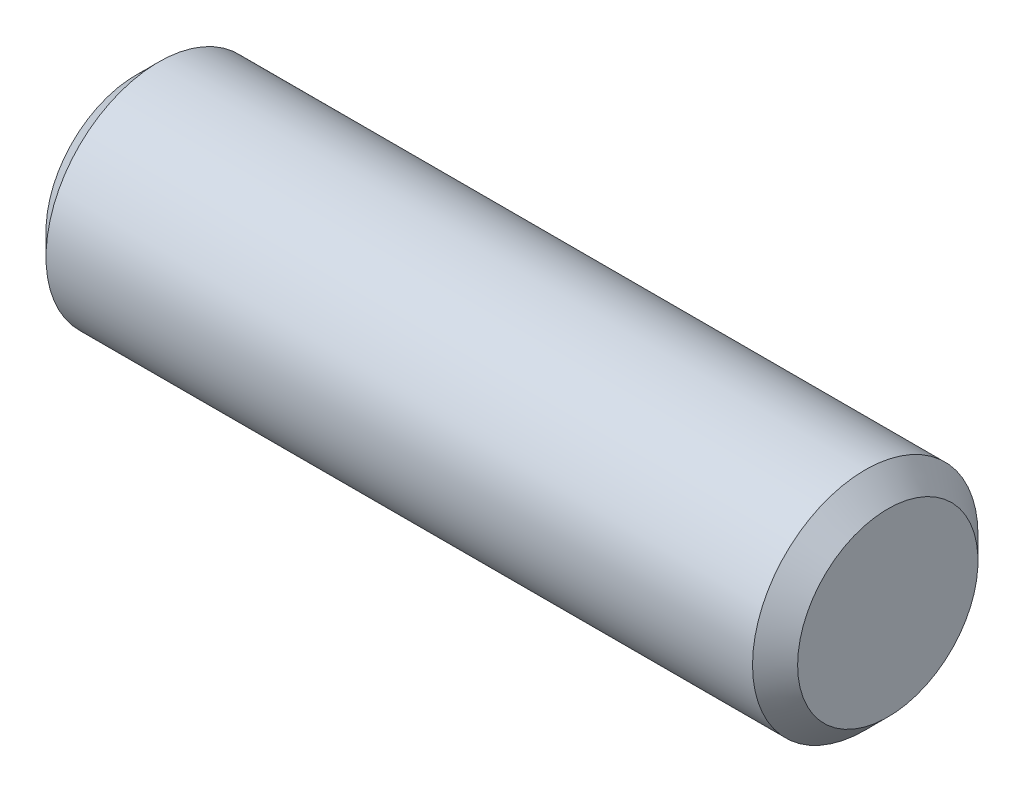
ISO-10303-21;
HEADER;
FILE_DESCRIPTION(('STEP AP214'),'2;1');
FILE_NAME('part.step','',(''),(''),'','','');
FILE_SCHEMA(('AUTOMOTIVE_DESIGN { 1 0 10303 214 1 1 1 1 }'));
ENDSEC;
DATA;
#1=APPLICATION_CONTEXT('core data for automotive mechanical design processes');
#2=APPLICATION_PROTOCOL_DEFINITION('international standard','automotive_design',2000,#1);
#3=PRODUCT_CONTEXT('',#1,'mechanical');
#4=PRODUCT('Part','Part','',(#3));
#5=PRODUCT_RELATED_PRODUCT_CATEGORY('part','',(#4));
#6=PRODUCT_DEFINITION_FORMATION('','',#4);
#7=PRODUCT_DEFINITION_CONTEXT('part definition',#1,'design');
#8=PRODUCT_DEFINITION('design','',#6,#7);
#9=PRODUCT_DEFINITION_SHAPE('','',#8);
#10=(LENGTH_UNIT() NAMED_UNIT(*) SI_UNIT(.MILLI.,.METRE.));
#11=(NAMED_UNIT(*) PLANE_ANGLE_UNIT() SI_UNIT($,.RADIAN.));
#12=(NAMED_UNIT(*) SI_UNIT($,.STERADIAN.) SOLID_ANGLE_UNIT());
#13=UNCERTAINTY_MEASURE_WITH_UNIT(LENGTH_MEASURE(1.E-05),#10,'distance_accuracy_value','');
#14=(GEOMETRIC_REPRESENTATION_CONTEXT(3) GLOBAL_UNCERTAINTY_ASSIGNED_CONTEXT((#13)) GLOBAL_UNIT_ASSIGNED_CONTEXT((#10,
#11,#12)) REPRESENTATION_CONTEXT('',''));
#15=CARTESIAN_POINT('',(0.,0.,0.));
#16=DIRECTION('',(0.,0.,1.));
#17=DIRECTION('',(1.,0.,0.));
#18=AXIS2_PLACEMENT_3D('',#15,#16,#17);
#19=CARTESIAN_POINT('',(-3.96875,0.,0.));
#20=DIRECTION('',(1.,0.,0.));
#21=DIRECTION('',(0.,0.,-1.));
#22=AXIS2_PLACEMENT_3D('',#19,#20,#21);
#23=CYLINDRICAL_SURFACE('',#22,1.190625);
#24=CARTESIAN_POINT('',(3.730625,0.,0.));
#25=DIRECTION('',(1.,0.,0.));
#26=DIRECTION('',(0.,0.,-1.));
#27=AXIS2_PLACEMENT_3D('',#24,#25,#26);
#28=CIRCLE('',#27,1.190625);
#29=CARTESIAN_POINT('',(3.730625,0.,1.190625));
#30=VERTEX_POINT('',#29);
#31=EDGE_CURVE('E44',#30,#30,#28,.F.);
#32=ORIENTED_EDGE('',*,*,#31,.T.);
#33=EDGE_LOOP('',(#32));
#34=FACE_BOUND('',#33,.T.);
#35=CARTESIAN_POINT('',(-3.730625,0.,0.));
#36=DIRECTION('',(1.,0.,0.));
#37=DIRECTION('',(0.,0.,-1.));
#38=AXIS2_PLACEMENT_3D('',#35,#36,#37);
#39=CIRCLE('',#38,1.190625);
#40=CARTESIAN_POINT('',(-3.730625,0.,-1.190625));
#41=VERTEX_POINT('',#40);
#42=EDGE_CURVE('E50',#41,#41,#39,.T.);
#43=ORIENTED_EDGE('',*,*,#42,.T.);
#44=EDGE_LOOP('',(#43));
#45=FACE_BOUND('',#44,.T.);
#46=ADVANCED_FACE('F36',(#34,#45),#23,.T.);
#47=CARTESIAN_POINT('',(-3.96875,0.,0.));
#48=DIRECTION('',(1.,0.,0.));
#49=DIRECTION('',(0.,0.,-1.));
#50=AXIS2_PLACEMENT_3D('',#47,#48,#49);
#51=PLANE('',#50);
#52=CARTESIAN_POINT('',(-3.96875,0.,0.));
#53=DIRECTION('',(1.,0.,0.));
#54=DIRECTION('',(0.,0.,-1.));
#55=AXIS2_PLACEMENT_3D('',#52,#53,#54);
#56=CIRCLE('',#55,0.9525);
#57=CARTESIAN_POINT('',(-3.96875,0.,-0.9525));
#58=VERTEX_POINT('',#57);
#59=EDGE_CURVE('E10',#58,#58,#56,.F.);
#60=ORIENTED_EDGE('',*,*,#59,.T.);
#61=EDGE_LOOP('',(#60));
#62=FACE_BOUND('',#61,.T.);
#63=ADVANCED_FACE('F71',(#62),#51,.F.);
#64=CARTESIAN_POINT('',(3.96875,0.,0.));
#65=DIRECTION('',(1.,0.,0.));
#66=DIRECTION('',(0.,0.,-1.));
#67=AXIS2_PLACEMENT_3D('',#64,#65,#66);
#68=PLANE('',#67);
#69=CARTESIAN_POINT('',(3.96875,0.,0.));
#70=DIRECTION('',(1.,0.,0.));
#71=DIRECTION('',(0.,0.,-1.));
#72=AXIS2_PLACEMENT_3D('',#69,#70,#71);
#73=CIRCLE('',#72,0.9525);
#74=CARTESIAN_POINT('',(3.96875,0.,0.952500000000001));
#75=VERTEX_POINT('',#74);
#76=EDGE_CURVE('E55',#75,#75,#73,.T.);
#77=ORIENTED_EDGE('',*,*,#76,.T.);
#78=EDGE_LOOP('',(#77));
#79=FACE_BOUND('',#78,.T.);
#80=ADVANCED_FACE('F61',(#79),#68,.T.);
#81=CARTESIAN_POINT('',(3.96875,0.,0.));
#82=DIRECTION('',(-1.,0.,0.));
#83=DIRECTION('',(0.,0.,1.));
#84=AXIS2_PLACEMENT_3D('',#81,#82,#83);
#85=CONICAL_SURFACE('',#84,0.9525,0.785398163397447);
#86=CARTESIAN_POINT('',(3.730625,0.,1.190625));
#87=CARTESIAN_POINT('',(3.73310546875,0.,1.18814453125));
#88=CARTESIAN_POINT('',(3.7355859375,0.,1.1856640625));
#89=CARTESIAN_POINT('',(3.740546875,0.,1.180703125));
#90=CARTESIAN_POINT('',(3.74302734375,0.,1.17822265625));
#91=CARTESIAN_POINT('',(3.74798828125,0.,1.17326171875));
#92=CARTESIAN_POINT('',(3.75046875,0.,1.17078125));
#93=CARTESIAN_POINT('',(3.7554296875,0.,1.1658203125));
#94=CARTESIAN_POINT('',(3.75791015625,0.,1.16333984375));
#95=CARTESIAN_POINT('',(3.76287109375,0.,1.15837890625));
#96=CARTESIAN_POINT('',(3.7653515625,0.,1.1558984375));
#97=CARTESIAN_POINT('',(3.7703125,0.,1.1509375));
#98=CARTESIAN_POINT('',(3.77279296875,0.,1.14845703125));
#99=CARTESIAN_POINT('',(3.77775390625,0.,1.14349609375));
#100=CARTESIAN_POINT('',(3.780234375,0.,1.141015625));
#101=CARTESIAN_POINT('',(3.7851953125,0.,1.1360546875));
#102=CARTESIAN_POINT('',(3.78767578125,0.,1.13357421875));
#103=CARTESIAN_POINT('',(3.79263671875,0.,1.12861328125));
#104=CARTESIAN_POINT('',(3.7951171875,0.,1.1261328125));
#105=CARTESIAN_POINT('',(3.800078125,0.,1.121171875));
#106=CARTESIAN_POINT('',(3.80255859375,0.,1.11869140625));
#107=CARTESIAN_POINT('',(3.80751953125,0.,1.11373046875));
#108=CARTESIAN_POINT('',(3.81,0.,1.11125));
#109=CARTESIAN_POINT('',(3.8149609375,0.,1.1062890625));
#110=CARTESIAN_POINT('',(3.81744140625,0.,1.10380859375));
#111=CARTESIAN_POINT('',(3.82240234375,0.,1.09884765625));
#112=CARTESIAN_POINT('',(3.8248828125,0.,1.0963671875));
#113=CARTESIAN_POINT('',(3.82984375,0.,1.09140625));
#114=CARTESIAN_POINT('',(3.83232421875,0.,1.08892578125));
#115=CARTESIAN_POINT('',(3.83728515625,0.,1.08396484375));
#116=CARTESIAN_POINT('',(3.839765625,0.,1.081484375));
#117=CARTESIAN_POINT('',(3.8447265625,0.,1.0765234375));
#118=CARTESIAN_POINT('',(3.84720703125,0.,1.07404296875));
#119=CARTESIAN_POINT('',(3.85216796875,0.,1.06908203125));
#120=CARTESIAN_POINT('',(3.8546484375,0.,1.0666015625));
#121=CARTESIAN_POINT('',(3.859609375,0.,1.061640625));
#122=CARTESIAN_POINT('',(3.86208984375,0.,1.05916015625));
#123=CARTESIAN_POINT('',(3.86705078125,0.,1.05419921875));
#124=CARTESIAN_POINT('',(3.86953125,0.,1.05171875));
#125=CARTESIAN_POINT('',(3.8744921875,0.,1.0467578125));
#126=CARTESIAN_POINT('',(3.87697265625,0.,1.04427734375));
#127=CARTESIAN_POINT('',(3.88193359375,0.,1.03931640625));
#128=CARTESIAN_POINT('',(3.8844140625,0.,1.0368359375));
#129=CARTESIAN_POINT('',(3.889375,0.,1.031875));
#130=CARTESIAN_POINT('',(3.89185546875,0.,1.02939453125));
#131=CARTESIAN_POINT('',(3.89681640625,0.,1.02443359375));
#132=CARTESIAN_POINT('',(3.899296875,0.,1.021953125));
#133=CARTESIAN_POINT('',(3.9042578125,0.,1.0169921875));
#134=CARTESIAN_POINT('',(3.90673828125,0.,1.01451171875));
#135=CARTESIAN_POINT('',(3.91169921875,0.,1.00955078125));
#136=CARTESIAN_POINT('',(3.9141796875,0.,1.0070703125));
#137=CARTESIAN_POINT('',(3.919140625,0.,1.002109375));
#138=CARTESIAN_POINT('',(3.92162109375,0.,0.999628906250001));
#139=CARTESIAN_POINT('',(3.92658203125,0.,0.994667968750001));
#140=CARTESIAN_POINT('',(3.9290625,0.,0.992187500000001));
#141=CARTESIAN_POINT('',(3.9340234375,0.,0.987226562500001));
#142=CARTESIAN_POINT('',(3.93650390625,0.,0.984746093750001));
#143=CARTESIAN_POINT('',(3.94146484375,0.,0.979785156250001));
#144=CARTESIAN_POINT('',(3.9439453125,0.,0.977304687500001));
#145=CARTESIAN_POINT('',(3.94890625,0.,0.972343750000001));
#146=CARTESIAN_POINT('',(3.95138671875,0.,0.969863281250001));
#147=CARTESIAN_POINT('',(3.95634765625,0.,0.964902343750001));
#148=CARTESIAN_POINT('',(3.958828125,0.,0.962421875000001));
#149=CARTESIAN_POINT('',(3.9637890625,0.,0.957460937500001));
#150=CARTESIAN_POINT('',(3.96626953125,0.,0.954980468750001));
#151=CARTESIAN_POINT('',(3.96875,0.,0.952500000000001));
#152=B_SPLINE_CURVE_WITH_KNOTS('',3,(#86,#87,#88,#89,#90,#91,#92,#93,#94,#95,#96,#97,#98,#99,
#100,#101,#102,#103,#104,#105,#106,#107,#108,#109,#110,#111,#112,#113,#114,#115,#116,#117,#118,
#119,#120,#121,#122,#123,#124,#125,#126,#127,#128,#129,#130,#131,#132,#133,#134,#135,#136,#137,
#138,#139,#140,#141,#142,#143,#144,#145,#146,#147,#148,#149,#150,#151),.UNSPECIFIED.,.F.,.F.,(4,
2,2,2,2,2,2,2,2,2,2,2,2,2,2,2,2,2,2,2,2,2,2,2,2,2,2,2,2,2,2,2,4),(0.,0.010523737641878,
0.021047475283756,0.0315712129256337,0.0420949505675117,0.0526186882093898,0.0631424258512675,
0.0736661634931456,0.0841899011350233,0.0947136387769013,0.105237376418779,0.115761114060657,
0.126284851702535,0.136808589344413,0.147332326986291,0.157856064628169,0.168379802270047,
0.178903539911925,0.189427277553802,0.19995101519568,0.210474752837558,0.220998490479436,
0.231522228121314,0.242045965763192,0.25256970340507,0.263093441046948,0.273617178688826,
0.284140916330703,0.294664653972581,0.305188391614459,0.315712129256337,0.326235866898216,
0.336759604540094),.UNSPECIFIED.);
#153=EDGE_CURVE('BSEAM63',#30,#75,#152,.T.);
#154=ORIENTED_EDGE('',*,*,#31,.F.);
#155=ORIENTED_EDGE('',*,*,#76,.F.);
#156=ORIENTED_EDGE('',*,*,#153,.T.);
#157=ORIENTED_EDGE('',*,*,#153,.F.);
#158=EDGE_LOOP('',(#154,#156,#155,#157));
#159=FACE_BOUND('',#158,.T.);
#160=ADVANCED_FACE('F63',(#159),#85,.T.);
#161=CARTESIAN_POINT('',(-3.730625,0.,0.));
#162=DIRECTION('',(1.,0.,0.));
#163=DIRECTION('',(0.,0.,-1.));
#164=AXIS2_PLACEMENT_3D('',#161,#162,#163);
#165=CONICAL_SURFACE('',#164,1.190625,0.785398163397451);
#166=ORIENTED_EDGE('',*,*,#59,.F.);
#167=EDGE_LOOP('',(#166));
#168=FACE_BOUND('',#167,.T.);
#169=ORIENTED_EDGE('',*,*,#42,.F.);
#170=EDGE_LOOP('',(#169));
#171=FACE_BOUND('',#170,.T.);
#172=ADVANCED_FACE('F38',(#168,#171),#165,.T.);
#173=CLOSED_SHELL('',(#46,#63,#80,#160,#172));
#174=MANIFOLD_SOLID_BREP('B2',#173);
#175=ADVANCED_BREP_SHAPE_REPRESENTATION('',(#18,#174),#14);
#176=SHAPE_DEFINITION_REPRESENTATION(#9,#175);
ENDSEC;
END-ISO-10303-21;
